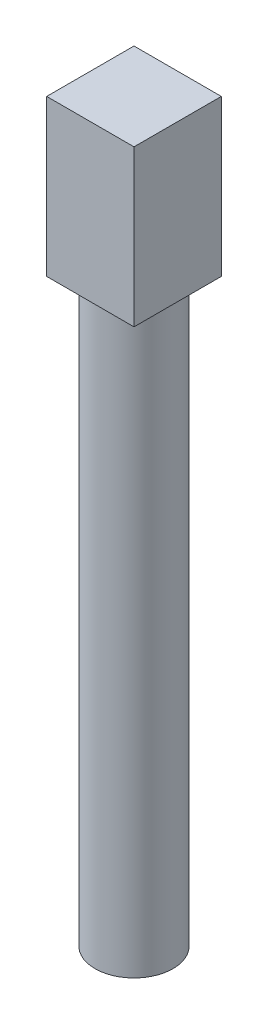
from build123d import *

# Parameters (mm, degrees)
SKETCH1_R           = 1.5875
BOSS_EXTRUDE1_DEPTH = 23.622
SKETCH2_W           = 3.556
SKETCH2_H           = 3.556
BOSS_EXTRUDE2_DEPTH = 6.35


with BuildPart() as part:
    # Sketch1 → Boss-Extrude1 (new body)
    with BuildSketch(Plane(origin=(0, 0, 0), x_dir=(1, 0, 0), z_dir=(0, 1, 0))):
        with Locations(Location((0, 0, 0), (0, 0, 270))):
            Circle(SKETCH1_R)
    extrude(amount=BOSS_EXTRUDE1_DEPTH)

    # Sketch2 → Boss-Extrude2 (add)
    with BuildSketch(Plane(origin=(0, 23.622, 0), x_dir=(1, 0, 0), z_dir=(0, 1, 0))):
        Rectangle(SKETCH2_W, SKETCH2_H)
    extrude(amount=BOSS_EXTRUDE2_DEPTH)


solid = part.part
